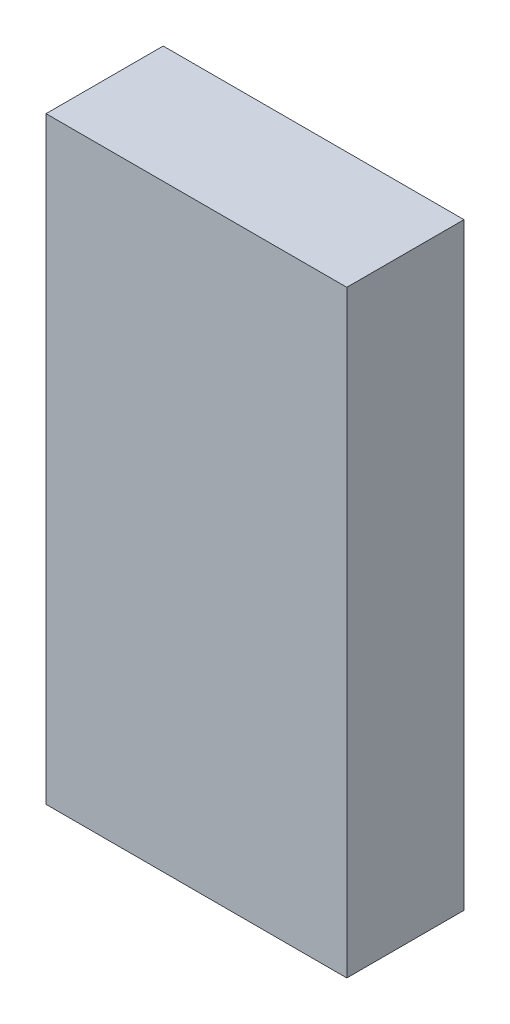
ISO-10303-21;
HEADER;
FILE_DESCRIPTION(('STEP AP214'),'2;1');
FILE_NAME('part.step','',(''),(''),'','','');
FILE_SCHEMA(('AUTOMOTIVE_DESIGN { 1 0 10303 214 1 1 1 1 }'));
ENDSEC;
DATA;
#1=APPLICATION_CONTEXT('core data for automotive mechanical design processes');
#2=APPLICATION_PROTOCOL_DEFINITION('international standard','automotive_design',2000,#1);
#3=PRODUCT_CONTEXT('',#1,'mechanical');
#4=PRODUCT('Part','Part','',(#3));
#5=PRODUCT_RELATED_PRODUCT_CATEGORY('part','',(#4));
#6=PRODUCT_DEFINITION_FORMATION('','',#4);
#7=PRODUCT_DEFINITION_CONTEXT('part definition',#1,'design');
#8=PRODUCT_DEFINITION('design','',#6,#7);
#9=PRODUCT_DEFINITION_SHAPE('','',#8);
#10=(LENGTH_UNIT() NAMED_UNIT(*) SI_UNIT(.MILLI.,.METRE.));
#11=(NAMED_UNIT(*) PLANE_ANGLE_UNIT() SI_UNIT($,.RADIAN.));
#12=(NAMED_UNIT(*) SI_UNIT($,.STERADIAN.) SOLID_ANGLE_UNIT());
#13=UNCERTAINTY_MEASURE_WITH_UNIT(LENGTH_MEASURE(1.E-05),#10,'distance_accuracy_value','');
#14=(GEOMETRIC_REPRESENTATION_CONTEXT(3) GLOBAL_UNCERTAINTY_ASSIGNED_CONTEXT((#13)) GLOBAL_UNIT_ASSIGNED_CONTEXT((#10,
#11,#12)) REPRESENTATION_CONTEXT('',''));
#15=CARTESIAN_POINT('',(0.,0.,0.));
#16=DIRECTION('',(0.,0.,1.));
#17=DIRECTION('',(1.,0.,0.));
#18=AXIS2_PLACEMENT_3D('',#15,#16,#17);
#19=CARTESIAN_POINT('',(-195.596,389.001,76.2));
#20=DIRECTION('',(0.,-1.,0.));
#21=DIRECTION('',(0.,0.,-1.));
#22=AXIS2_PLACEMENT_3D('',#19,#20,#21);
#23=PLANE('',#22);
#24=DIRECTION('',(-1.,0.,0.));
#25=VECTOR('',#24,1.);
#26=CARTESIAN_POINT('',(-195.596,389.001,-76.2));
#27=LINE('',#26,#25);
#28=CARTESIAN_POINT('',(195.596,389.001,-76.2));
#29=VERTEX_POINT('',#28);
#30=CARTESIAN_POINT('',(-195.596,389.001,-76.2));
#31=VERTEX_POINT('',#30);
#32=EDGE_CURVE('E114',#29,#31,#27,.T.);
#33=ORIENTED_EDGE('',*,*,#32,.T.);
#34=DIRECTION('',(0.,0.,-1.));
#35=VECTOR('',#34,1.);
#36=CARTESIAN_POINT('',(-195.596,389.001,76.2));
#37=LINE('',#36,#35);
#38=CARTESIAN_POINT('',(-195.596,389.001,76.2));
#39=VERTEX_POINT('',#38);
#40=EDGE_CURVE('E11',#39,#31,#37,.T.);
#41=ORIENTED_EDGE('',*,*,#40,.F.);
#42=DIRECTION('',(-1.,0.,0.));
#43=VECTOR('',#42,1.);
#44=CARTESIAN_POINT('',(-195.596,389.001,76.2));
#45=LINE('',#44,#43);
#46=CARTESIAN_POINT('',(195.596,389.001,76.2));
#47=VERTEX_POINT('',#46);
#48=EDGE_CURVE('E100',#47,#39,#45,.T.);
#49=ORIENTED_EDGE('',*,*,#48,.F.);
#50=DIRECTION('',(0.,0.,-1.));
#51=VECTOR('',#50,1.);
#52=CARTESIAN_POINT('',(195.596,389.001,76.2));
#53=LINE('',#52,#51);
#54=EDGE_CURVE('E108',#47,#29,#53,.T.);
#55=ORIENTED_EDGE('',*,*,#54,.T.);
#56=EDGE_LOOP('',(#33,#41,#49,#55));
#57=FACE_BOUND('',#56,.T.);
#58=ADVANCED_FACE('F44',(#57),#23,.F.);
#59=CARTESIAN_POINT('',(-195.596,-389.001,76.2));
#60=DIRECTION('',(1.,0.,0.));
#61=DIRECTION('',(0.,0.,-1.));
#62=AXIS2_PLACEMENT_3D('',#59,#60,#61);
#63=PLANE('',#62);
#64=DIRECTION('',(0.,-1.,0.));
#65=VECTOR('',#64,1.);
#66=CARTESIAN_POINT('',(-195.596,-389.001,-76.2));
#67=LINE('',#66,#65);
#68=CARTESIAN_POINT('',(-195.596,-389.001,-76.2));
#69=VERTEX_POINT('',#68);
#70=EDGE_CURVE('E105',#31,#69,#67,.T.);
#71=ORIENTED_EDGE('',*,*,#70,.T.);
#72=DIRECTION('',(0.,0.,-1.));
#73=VECTOR('',#72,1.);
#74=CARTESIAN_POINT('',(-195.596,-389.001,76.2));
#75=LINE('',#74,#73);
#76=CARTESIAN_POINT('',(-195.596,-389.001,76.2));
#77=VERTEX_POINT('',#76);
#78=EDGE_CURVE('E53',#77,#69,#75,.T.);
#79=ORIENTED_EDGE('',*,*,#78,.F.);
#80=DIRECTION('',(0.,-1.,0.));
#81=VECTOR('',#80,1.);
#82=CARTESIAN_POINT('',(-195.596,-389.001,76.2));
#83=LINE('',#82,#81);
#84=EDGE_CURVE('E95',#39,#77,#83,.T.);
#85=ORIENTED_EDGE('',*,*,#84,.F.);
#86=ORIENTED_EDGE('',*,*,#40,.T.);
#87=EDGE_LOOP('',(#71,#79,#85,#86));
#88=FACE_BOUND('',#87,.T.);
#89=ADVANCED_FACE('F101',(#88),#63,.F.);
#90=CARTESIAN_POINT('',(-195.596,-389.001,76.2));
#91=DIRECTION('',(0.,1.,0.));
#92=DIRECTION('',(0.,0.,1.));
#93=AXIS2_PLACEMENT_3D('',#90,#91,#92);
#94=PLANE('',#93);
#95=DIRECTION('',(1.,0.,0.));
#96=VECTOR('',#95,1.);
#97=CARTESIAN_POINT('',(-195.596,-389.001,-76.2));
#98=LINE('',#97,#96);
#99=CARTESIAN_POINT('',(195.596,-389.001,-76.2));
#100=VERTEX_POINT('',#99);
#101=EDGE_CURVE('E78',#69,#100,#98,.T.);
#102=ORIENTED_EDGE('',*,*,#101,.T.);
#103=DIRECTION('',(0.,0.,-1.));
#104=VECTOR('',#103,1.);
#105=CARTESIAN_POINT('',(195.596,-389.001,76.2));
#106=LINE('',#105,#104);
#107=CARTESIAN_POINT('',(195.596,-389.001,76.2));
#108=VERTEX_POINT('',#107);
#109=EDGE_CURVE('E102',#108,#100,#106,.T.);
#110=ORIENTED_EDGE('',*,*,#109,.F.);
#111=DIRECTION('',(1.,0.,0.));
#112=VECTOR('',#111,1.);
#113=CARTESIAN_POINT('',(-195.596,-389.001,76.2));
#114=LINE('',#113,#112);
#115=EDGE_CURVE('E92',#77,#108,#114,.T.);
#116=ORIENTED_EDGE('',*,*,#115,.F.);
#117=ORIENTED_EDGE('',*,*,#78,.T.);
#118=EDGE_LOOP('',(#102,#110,#116,#117));
#119=FACE_BOUND('',#118,.T.);
#120=ADVANCED_FACE('F104',(#119),#94,.F.);
#121=CARTESIAN_POINT('',(195.596,-389.001,76.2));
#122=DIRECTION('',(-1.,0.,0.));
#123=DIRECTION('',(0.,0.,1.));
#124=AXIS2_PLACEMENT_3D('',#121,#122,#123);
#125=PLANE('',#124);
#126=DIRECTION('',(0.,1.,0.));
#127=VECTOR('',#126,1.);
#128=CARTESIAN_POINT('',(195.596,-389.001,-76.2));
#129=LINE('',#128,#127);
#130=EDGE_CURVE('E84',#100,#29,#129,.T.);
#131=ORIENTED_EDGE('',*,*,#130,.T.);
#132=ORIENTED_EDGE('',*,*,#54,.F.);
#133=DIRECTION('',(0.,1.,0.));
#134=VECTOR('',#133,1.);
#135=CARTESIAN_POINT('',(195.596,-389.001,76.2));
#136=LINE('',#135,#134);
#137=EDGE_CURVE('E62',#108,#47,#136,.T.);
#138=ORIENTED_EDGE('',*,*,#137,.F.);
#139=ORIENTED_EDGE('',*,*,#109,.T.);
#140=EDGE_LOOP('',(#131,#132,#138,#139));
#141=FACE_BOUND('',#140,.T.);
#142=ADVANCED_FACE('F127',(#141),#125,.F.);
#143=CARTESIAN_POINT('',(0.,0.,76.2));
#144=DIRECTION('',(0.,0.,1.));
#145=DIRECTION('',(1.,0.,0.));
#146=AXIS2_PLACEMENT_3D('',#143,#144,#145);
#147=PLANE('',#146);
#148=ORIENTED_EDGE('',*,*,#48,.T.);
#149=ORIENTED_EDGE('',*,*,#84,.T.);
#150=ORIENTED_EDGE('',*,*,#115,.T.);
#151=ORIENTED_EDGE('',*,*,#137,.T.);
#152=EDGE_LOOP('',(#148,#149,#150,#151));
#153=FACE_BOUND('',#152,.T.);
#154=ADVANCED_FACE('F91',(#153),#147,.T.);
#155=CARTESIAN_POINT('',(0.,0.,-76.2));
#156=DIRECTION('',(0.,0.,1.));
#157=DIRECTION('',(1.,0.,0.));
#158=AXIS2_PLACEMENT_3D('',#155,#156,#157);
#159=PLANE('',#158);
#160=ORIENTED_EDGE('',*,*,#32,.F.);
#161=ORIENTED_EDGE('',*,*,#130,.F.);
#162=ORIENTED_EDGE('',*,*,#101,.F.);
#163=ORIENTED_EDGE('',*,*,#70,.F.);
#164=EDGE_LOOP('',(#160,#161,#162,#163));
#165=FACE_BOUND('',#164,.T.);
#166=ADVANCED_FACE('F129',(#165),#159,.F.);
#167=CLOSED_SHELL('',(#58,#89,#120,#142,#154,#166));
#168=MANIFOLD_SOLID_BREP('B2',#167);
#169=ADVANCED_BREP_SHAPE_REPRESENTATION('',(#18,#168),#14);
#170=SHAPE_DEFINITION_REPRESENTATION(#9,#169);
ENDSEC;
END-ISO-10303-21;
